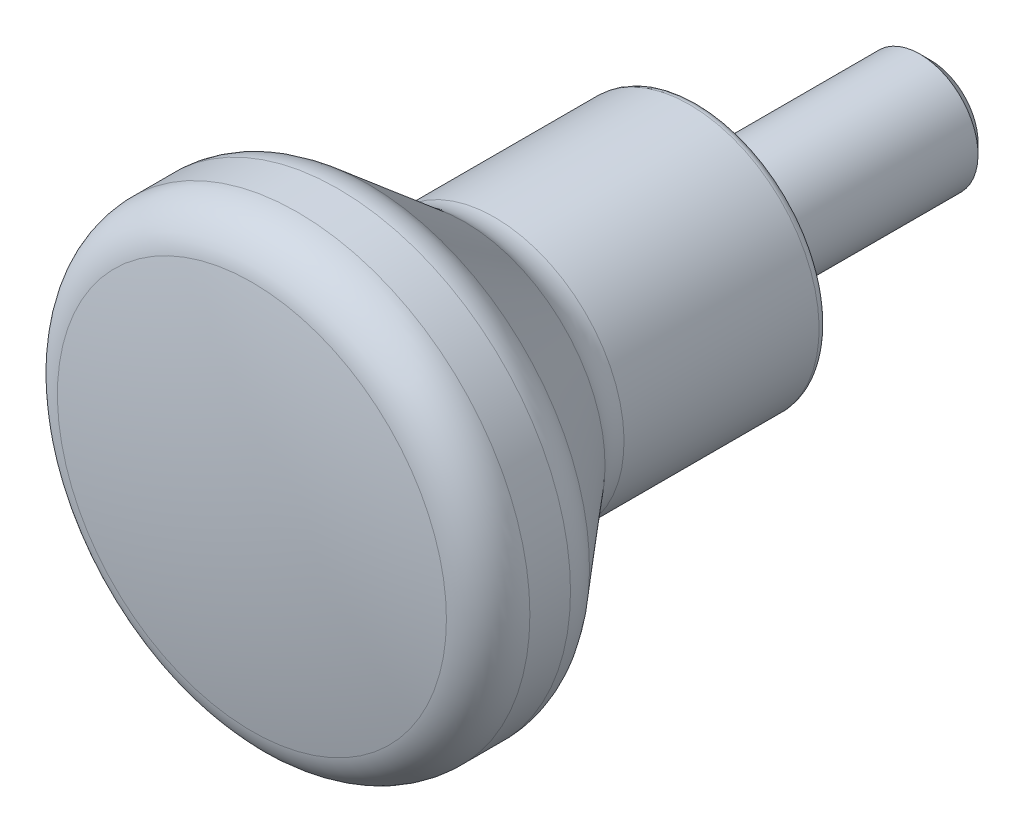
ISO-10303-21;
HEADER;
FILE_DESCRIPTION(('STEP AP214'),'2;1');
FILE_NAME('part.step','',(''),(''),'','','');
FILE_SCHEMA(('AUTOMOTIVE_DESIGN { 1 0 10303 214 1 1 1 1 }'));
ENDSEC;
DATA;
#1=APPLICATION_CONTEXT('core data for automotive mechanical design processes');
#2=APPLICATION_PROTOCOL_DEFINITION('international standard','automotive_design',2000,#1);
#3=PRODUCT_CONTEXT('',#1,'mechanical');
#4=PRODUCT('Part','Part','',(#3));
#5=PRODUCT_RELATED_PRODUCT_CATEGORY('part','',(#4));
#6=PRODUCT_DEFINITION_FORMATION('','',#4);
#7=PRODUCT_DEFINITION_CONTEXT('part definition',#1,'design');
#8=PRODUCT_DEFINITION('design','',#6,#7);
#9=PRODUCT_DEFINITION_SHAPE('','',#8);
#10=(LENGTH_UNIT() NAMED_UNIT(*) SI_UNIT(.MILLI.,.METRE.));
#11=(NAMED_UNIT(*) PLANE_ANGLE_UNIT() SI_UNIT($,.RADIAN.));
#12=(NAMED_UNIT(*) SI_UNIT($,.STERADIAN.) SOLID_ANGLE_UNIT());
#13=UNCERTAINTY_MEASURE_WITH_UNIT(LENGTH_MEASURE(1.E-05),#10,'distance_accuracy_value','');
#14=(GEOMETRIC_REPRESENTATION_CONTEXT(3) GLOBAL_UNCERTAINTY_ASSIGNED_CONTEXT((#13)) GLOBAL_UNIT_ASSIGNED_CONTEXT((#10,
#11,#12)) REPRESENTATION_CONTEXT('',''));
#15=CARTESIAN_POINT('',(0.,0.,0.));
#16=DIRECTION('',(0.,0.,1.));
#17=DIRECTION('',(1.,0.,0.));
#18=AXIS2_PLACEMENT_3D('',#15,#16,#17);
#19=CARTESIAN_POINT('',(0.,0.,-49.9999999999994));
#20=DIRECTION('',(0.,0.,-1.));
#21=DIRECTION('',(1.,0.,0.));
#22=AXIS2_PLACEMENT_3D('',#19,#20,#21);
#23=SPHERICAL_SURFACE('',#22,90.);
#24=CARTESIAN_POINT('',(0.,0.,38.4286844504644));
#25=DIRECTION('',(0.,0.,-1.));
#26=DIRECTION('',(0.,1.,0.));
#27=AXIS2_PLACEMENT_3D('',#24,#25,#26);
#28=CIRCLE('',#27,16.7441860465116);
#29=CARTESIAN_POINT('',(0.,16.7441860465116,38.4286844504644));
#30=VERTEX_POINT('',#29);
#31=EDGE_CURVE('E18',#30,#30,#28,.T.);
#32=ORIENTED_EDGE('',*,*,#31,.F.);
#33=EDGE_LOOP('',(#32));
#34=FACE_BOUND('',#33,.T.);
#35=ADVANCED_FACE('F12',(#34),#23,.T.);
#36=CARTESIAN_POINT('',(0.,0.,34.4985206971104));
#37=DIRECTION('',(0.,0.,-1.));
#38=DIRECTION('',(0.,1.,0.));
#39=AXIS2_PLACEMENT_3D('',#36,#37,#38);
#40=TOROIDAL_SURFACE('',#39,16.,4.);
#41=ORIENTED_EDGE('',*,*,#31,.T.);
#42=EDGE_LOOP('',(#41));
#43=FACE_BOUND('',#42,.T.);
#44=CARTESIAN_POINT('',(0.,0.,34.4985206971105));
#45=DIRECTION('',(0.,0.,-1.));
#46=DIRECTION('',(0.,1.,0.));
#47=AXIS2_PLACEMENT_3D('',#44,#45,#46);
#48=CIRCLE('',#47,20.);
#49=CARTESIAN_POINT('',(0.,20.,34.4985206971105));
#50=VERTEX_POINT('',#49);
#51=EDGE_CURVE('E22',#50,#50,#48,.T.);
#52=ORIENTED_EDGE('',*,*,#51,.F.);
#53=EDGE_LOOP('',(#52));
#54=FACE_BOUND('',#53,.T.);
#55=ADVANCED_FACE('F69',(#43,#54),#40,.T.);
#56=CARTESIAN_POINT('',(0.,0.,0.));
#57=DIRECTION('',(0.,0.,-1.));
#58=DIRECTION('',(0.,1.,0.));
#59=AXIS2_PLACEMENT_3D('',#56,#57,#58);
#60=CYLINDRICAL_SURFACE('',#59,20.);
#61=CARTESIAN_POINT('',(0.,0.,31.0029002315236));
#62=DIRECTION('',(0.,0.,-1.));
#63=DIRECTION('',(0.,1.,0.));
#64=AXIS2_PLACEMENT_3D('',#61,#62,#63);
#65=CIRCLE('',#64,20.);
#66=CARTESIAN_POINT('',(0.,20.,31.0029002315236));
#67=VERTEX_POINT('',#66);
#68=EDGE_CURVE('E26',#67,#67,#65,.T.);
#69=ORIENTED_EDGE('',*,*,#68,.F.);
#70=EDGE_LOOP('',(#69));
#71=FACE_BOUND('',#70,.T.);
#72=ORIENTED_EDGE('',*,*,#51,.T.);
#73=EDGE_LOOP('',(#72));
#74=FACE_BOUND('',#73,.T.);
#75=ADVANCED_FACE('F74',(#71,#74),#60,.T.);
#76=CARTESIAN_POINT('',(0.,0.,31.0029002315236));
#77=DIRECTION('',(0.,0.,-1.));
#78=DIRECTION('',(0.,1.,0.));
#79=AXIS2_PLACEMENT_3D('',#76,#77,#78);
#80=TOROIDAL_SURFACE('',#79,16.,4.);
#81=ORIENTED_EDGE('',*,*,#68,.T.);
#82=EDGE_LOOP('',(#81));
#83=FACE_BOUND('',#82,.T.);
#84=CARTESIAN_POINT('',(0.,0.,28.4317497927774));
#85=DIRECTION('',(0.,0.,-1.));
#86=DIRECTION('',(0.,1.,0.));
#87=AXIS2_PLACEMENT_3D('',#84,#85,#86);
#88=CIRCLE('',#87,19.0641777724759);
#89=CARTESIAN_POINT('',(0.,19.0641777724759,28.4317497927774));
#90=VERTEX_POINT('',#89);
#91=EDGE_CURVE('E31',#90,#90,#88,.T.);
#92=ORIENTED_EDGE('',*,*,#91,.F.);
#93=EDGE_LOOP('',(#92));
#94=FACE_BOUND('',#93,.T.);
#95=ADVANCED_FACE('F78',(#83,#94),#80,.T.);
#96=CARTESIAN_POINT('',(0.,0.,28.4317497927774));
#97=DIRECTION('',(0.,0.,1.));
#98=DIRECTION('',(0.,-1.,0.));
#99=AXIS2_PLACEMENT_3D('',#96,#97,#98);
#100=CONICAL_SURFACE('',#99,19.0641777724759,0.698131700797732);
#101=CARTESIAN_POINT('',(0.,0.,20.1152695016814));
#102=DIRECTION('',(0.,0.,-1.));
#103=DIRECTION('',(0.,1.,0.));
#104=AXIS2_PLACEMENT_3D('',#101,#102,#103);
#105=CIRCLE('',#104,12.0858222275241);
#106=CARTESIAN_POINT('',(0.,12.0858222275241,20.1152695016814));
#107=VERTEX_POINT('',#106);
#108=EDGE_CURVE('E34',#107,#107,#105,.T.);
#109=ORIENTED_EDGE('',*,*,#108,.F.);
#110=EDGE_LOOP('',(#109));
#111=FACE_BOUND('',#110,.T.);
#112=ORIENTED_EDGE('',*,*,#91,.T.);
#113=EDGE_LOOP('',(#112));
#114=FACE_BOUND('',#113,.T.);
#115=ADVANCED_FACE('F85',(#111,#114),#100,.T.);
#116=CARTESIAN_POINT('',(0.,0.,17.5441190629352));
#117=DIRECTION('',(0.,0.,-1.));
#118=DIRECTION('',(0.,1.,0.));
#119=AXIS2_PLACEMENT_3D('',#116,#117,#118);
#120=TOROIDAL_SURFACE('',#119,15.15,4.);
#121=CARTESIAN_POINT('',(0.,0.,17.5441190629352));
#122=DIRECTION('',(0.,0.,-1.));
#123=DIRECTION('',(0.,1.,0.));
#124=AXIS2_PLACEMENT_3D('',#121,#122,#123);
#125=CIRCLE('',#124,11.15);
#126=CARTESIAN_POINT('',(0.,11.15,17.5441190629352));
#127=VERTEX_POINT('',#126);
#128=EDGE_CURVE('E37',#127,#127,#125,.T.);
#129=ORIENTED_EDGE('',*,*,#128,.F.);
#130=EDGE_LOOP('',(#129));
#131=FACE_BOUND('',#130,.T.);
#132=ORIENTED_EDGE('',*,*,#108,.T.);
#133=EDGE_LOOP('',(#132));
#134=FACE_BOUND('',#133,.T.);
#135=ADVANCED_FACE('F89',(#131,#134),#120,.F.);
#136=CARTESIAN_POINT('',(0.,0.,0.));
#137=DIRECTION('',(0.,0.,-1.));
#138=DIRECTION('',(0.,1.,0.));
#139=AXIS2_PLACEMENT_3D('',#136,#137,#138);
#140=CYLINDRICAL_SURFACE('',#139,11.15);
#141=CARTESIAN_POINT('',(0.,0.,0.75));
#142=DIRECTION('',(0.,0.,-1.));
#143=DIRECTION('',(0.,1.,0.));
#144=AXIS2_PLACEMENT_3D('',#141,#142,#143);
#145=CIRCLE('',#144,11.15);
#146=CARTESIAN_POINT('',(0.,11.15,0.75));
#147=VERTEX_POINT('',#146);
#148=EDGE_CURVE('E40',#147,#147,#145,.T.);
#149=ORIENTED_EDGE('',*,*,#148,.F.);
#150=EDGE_LOOP('',(#149));
#151=FACE_BOUND('',#150,.T.);
#152=ORIENTED_EDGE('',*,*,#128,.T.);
#153=EDGE_LOOP('',(#152));
#154=FACE_BOUND('',#153,.T.);
#155=ADVANCED_FACE('F93',(#151,#154),#140,.T.);
#156=CARTESIAN_POINT('',(0.,0.,0.75));
#157=DIRECTION('',(0.,0.,-1.));
#158=DIRECTION('',(0.,1.,0.));
#159=AXIS2_PLACEMENT_3D('',#156,#157,#158);
#160=TOROIDAL_SURFACE('',#159,10.4,0.75);
#161=ORIENTED_EDGE('',*,*,#148,.T.);
#162=EDGE_LOOP('',(#161));
#163=FACE_BOUND('',#162,.T.);
#164=CARTESIAN_POINT('',(0.,0.,0.));
#165=DIRECTION('',(0.,0.,-1.));
#166=DIRECTION('',(0.,1.,0.));
#167=AXIS2_PLACEMENT_3D('',#164,#165,#166);
#168=CIRCLE('',#167,10.4);
#169=CARTESIAN_POINT('',(0.,10.4,0.));
#170=VERTEX_POINT('',#169);
#171=EDGE_CURVE('E43',#170,#170,#168,.T.);
#172=ORIENTED_EDGE('',*,*,#171,.F.);
#173=EDGE_LOOP('',(#172));
#174=FACE_BOUND('',#173,.T.);
#175=ADVANCED_FACE('F97',(#163,#174),#160,.T.);
#176=CARTESIAN_POINT('',(10.4,0.,0.));
#177=DIRECTION('',(0.,0.,1.));
#178=DIRECTION('',(0.,-1.,0.));
#179=AXIS2_PLACEMENT_3D('',#176,#177,#178);
#180=PLANE('',#179);
#181=CARTESIAN_POINT('',(0.,0.,0.));
#182=DIRECTION('',(0.,0.,1.));
#183=DIRECTION('',(0.,-1.,0.));
#184=AXIS2_PLACEMENT_3D('',#181,#182,#183);
#185=CIRCLE('',#184,5.);
#186=CARTESIAN_POINT('',(0.,-5.,0.));
#187=VERTEX_POINT('',#186);
#188=EDGE_CURVE('E8',#187,#187,#185,.F.);
#189=ORIENTED_EDGE('',*,*,#188,.F.);
#190=EDGE_LOOP('',(#189));
#191=FACE_BOUND('',#190,.T.);
#192=ORIENTED_EDGE('',*,*,#171,.T.);
#193=EDGE_LOOP('',(#192));
#194=FACE_BOUND('',#193,.T.);
#195=ADVANCED_FACE('F100',(#191,#194),#180,.F.);
#196=CARTESIAN_POINT('',(4.08,0.,-20.));
#197=DIRECTION('',(0.,0.,1.));
#198=DIRECTION('',(0.,-1.,0.));
#199=AXIS2_PLACEMENT_3D('',#196,#197,#198);
#200=PLANE('',#199);
#201=CARTESIAN_POINT('',(0.,0.,-20.));
#202=DIRECTION('',(0.,0.,-1.));
#203=DIRECTION('',(0.,1.,0.));
#204=AXIS2_PLACEMENT_3D('',#201,#202,#203);
#205=CIRCLE('',#204,4.08);
#206=CARTESIAN_POINT('',(0.,4.08,-20.));
#207=VERTEX_POINT('',#206);
#208=EDGE_CURVE('E49',#207,#207,#205,.T.);
#209=ORIENTED_EDGE('',*,*,#208,.T.);
#210=EDGE_LOOP('',(#209));
#211=FACE_BOUND('',#210,.T.);
#212=ADVANCED_FACE('F53',(#211),#200,.F.);
#213=CARTESIAN_POINT('',(0.,0.,-19.08));
#214=DIRECTION('',(0.,0.,1.));
#215=DIRECTION('',(0.,-1.,0.));
#216=AXIS2_PLACEMENT_3D('',#213,#214,#215);
#217=CONICAL_SURFACE('',#216,5.,0.785398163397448);
#218=ORIENTED_EDGE('',*,*,#208,.F.);
#219=EDGE_LOOP('',(#218));
#220=FACE_BOUND('',#219,.T.);
#221=CARTESIAN_POINT('',(0.,0.,-19.08));
#222=DIRECTION('',(0.,0.,-1.));
#223=DIRECTION('',(0.,1.,0.));
#224=AXIS2_PLACEMENT_3D('',#221,#222,#223);
#225=CIRCLE('',#224,5.);
#226=CARTESIAN_POINT('',(0.,5.,-19.08));
#227=VERTEX_POINT('',#226);
#228=EDGE_CURVE('E46',#227,#227,#225,.T.);
#229=ORIENTED_EDGE('',*,*,#228,.T.);
#230=EDGE_LOOP('',(#229));
#231=FACE_BOUND('',#230,.T.);
#232=ADVANCED_FACE('F55',(#220,#231),#217,.T.);
#233=CARTESIAN_POINT('',(0.,0.,-20.));
#234=DIRECTION('',(0.,0.,-1.));
#235=DIRECTION('',(0.,1.,0.));
#236=AXIS2_PLACEMENT_3D('',#233,#234,#235);
#237=CYLINDRICAL_SURFACE('',#236,5.);
#238=ORIENTED_EDGE('',*,*,#228,.F.);
#239=EDGE_LOOP('',(#238));
#240=FACE_BOUND('',#239,.T.);
#241=ORIENTED_EDGE('',*,*,#188,.T.);
#242=EDGE_LOOP('',(#241));
#243=FACE_BOUND('',#242,.T.);
#244=ADVANCED_FACE('F58',(#240,#243),#237,.T.);
#245=CLOSED_SHELL('',(#35,#55,#75,#95,#115,#135,#155,#175,#195,#212,#232,#244));
#246=MANIFOLD_SOLID_BREP('B1',#245);
#247=ADVANCED_BREP_SHAPE_REPRESENTATION('',(#18,#246),#14);
#248=SHAPE_DEFINITION_REPRESENTATION(#9,#247);
ENDSEC;
END-ISO-10303-21;
